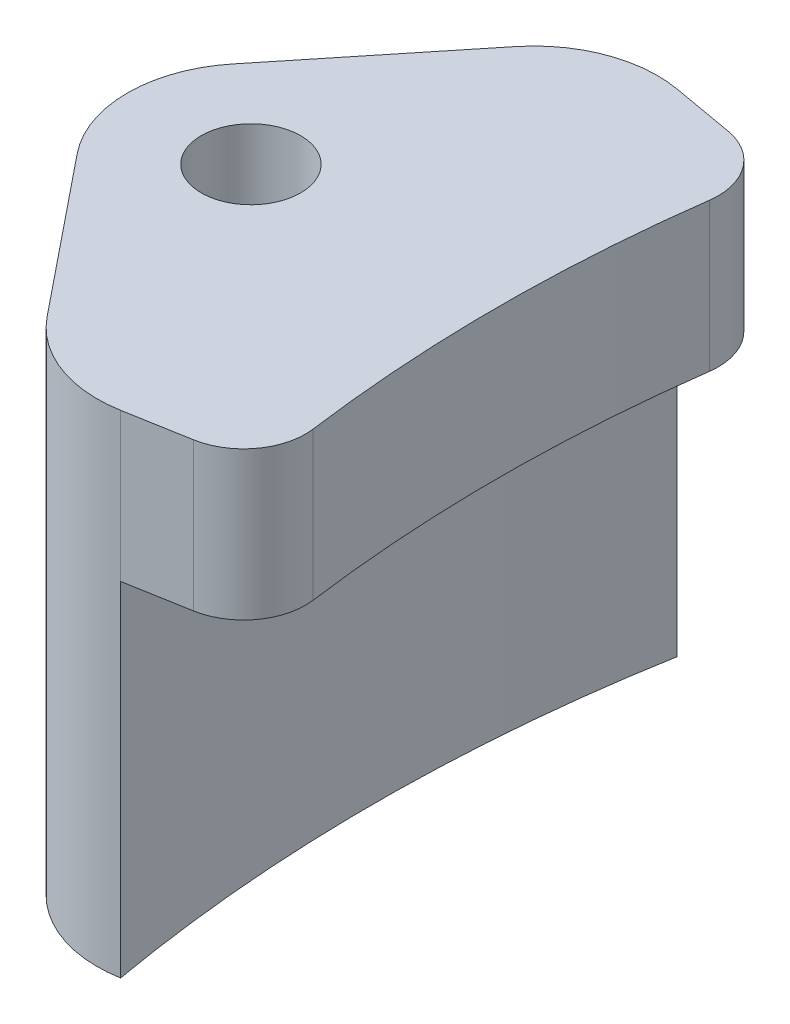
from build123d import *

# Parameters (mm, degrees)
REVOLVE1_ANGLE          = 20
F_1_4_20_TAPPED_HOLE1_D = 5.1054
CUT_EXTRUDE1_DEPTH      = 100.738425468
FILLET2_R               = 3.175


with BuildPart() as part:
    # Sketch1 → Revolve1 (revolve, symmetric)
    with BuildSketch(Plane.XY) as revolve1_sk:
        Polygon((-76.010737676, 17.78), (-82.360737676, 17.78), (-82.360737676, 0.127), (-95.060737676, 0.127), (-95.060737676, 25.4), (-76.010737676, 25.4), align=None)
    revolve(axis=Axis((0, 21.554666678, 0), (0, 1, 0)), revolution_arc=REVOLVE1_ANGLE / 2)
    revolve(revolve1_sk.sketch, axis=Axis((0, 21.554666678, 0), (0, -1, 0)), revolution_arc=REVOLVE1_ANGLE / 2)

    # 1_4-20 Tapped Hole1 (through all)
    with Locations(Plane(origin=(0, 0.127, 0), x_dir=(-1, 0, 0), z_dir=(0, -1, 0))):
        with Locations((88.710737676, 0)):
            Hole(F_1_4_20_TAPPED_HOLE1_D / 2)

    # Sketch4 → Cut-Extrude1 (cut, through all)
    with BuildSketch(Plane(origin=(0, 25.4, 0), x_dir=(1, 0, 0), z_dir=(0, 1, 0))):
        with BuildLine():
            Line((-93.651246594, -3.989219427), (-87.152667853, -12.037482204))
            ThreePointArc((-87.152667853, -12.037482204), (-84.440170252, -13.994561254), (-81.109493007, -14.301792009))
            Line((-81.109493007, -14.301792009), (-93.61655147, -16.507123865))
            ThreePointArc((-93.61655147, -16.507123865), (-97.0679535, 0), (-93.61655147, 16.507123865))
            Line((-93.61655147, 16.507123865), (-81.109493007, 14.301792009))
            ThreePointArc((-81.109493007, 14.301792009), (-84.440170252, 13.994561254), (-87.152667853, 12.037482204))
            Line((-87.152667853, 12.037482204), (-93.651246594, 3.989219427))
            ThreePointArc((-93.651246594, 3.989219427), (-95.060737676, 0), (-93.651246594, -3.989219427))
        make_face()
    extrude(amount=-CUT_EXTRUDE1_DEPTH, mode=Mode.SUBTRACT)

    # Fillet2
    fillet2_edges = [part.edges().sort_by_distance(p)[0] for p in [
        (-74.855963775, 21.59, 13.199126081),
        (-74.855963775, 21.59, -13.199126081),
    ]]
    fillet(fillet2_edges, radius=FILLET2_R)


solid = part.part
